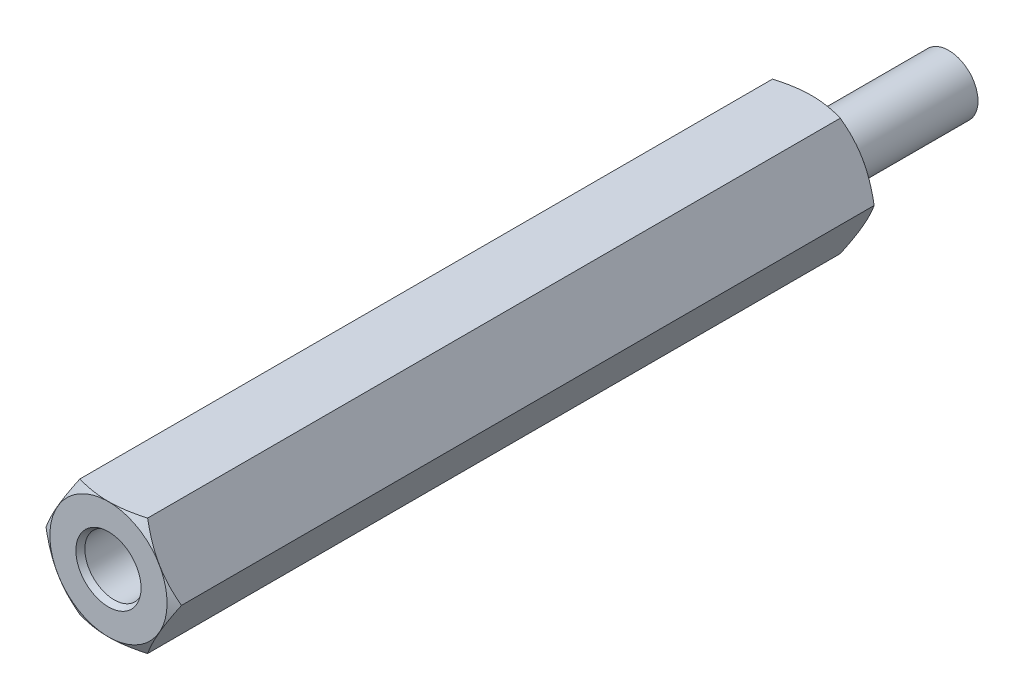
ISO-10303-21;
HEADER;
FILE_DESCRIPTION(('STEP AP214'),'2;1');
FILE_NAME('part.step','',(''),(''),'','','');
FILE_SCHEMA(('AUTOMOTIVE_DESIGN { 1 0 10303 214 1 1 1 1 }'));
ENDSEC;
DATA;
#1=APPLICATION_CONTEXT('core data for automotive mechanical design processes');
#2=APPLICATION_PROTOCOL_DEFINITION('international standard','automotive_design',2000,#1);
#3=PRODUCT_CONTEXT('',#1,'mechanical');
#4=PRODUCT('Part','Part','',(#3));
#5=PRODUCT_RELATED_PRODUCT_CATEGORY('part','',(#4));
#6=PRODUCT_DEFINITION_FORMATION('','',#4);
#7=PRODUCT_DEFINITION_CONTEXT('part definition',#1,'design');
#8=PRODUCT_DEFINITION('design','',#6,#7);
#9=PRODUCT_DEFINITION_SHAPE('','',#8);
#10=(LENGTH_UNIT() NAMED_UNIT(*) SI_UNIT(.MILLI.,.METRE.));
#11=(NAMED_UNIT(*) PLANE_ANGLE_UNIT() SI_UNIT($,.RADIAN.));
#12=(NAMED_UNIT(*) SI_UNIT($,.STERADIAN.) SOLID_ANGLE_UNIT());
#13=UNCERTAINTY_MEASURE_WITH_UNIT(LENGTH_MEASURE(1.E-05),#10,'distance_accuracy_value','');
#14=(GEOMETRIC_REPRESENTATION_CONTEXT(3) GLOBAL_UNCERTAINTY_ASSIGNED_CONTEXT((#13)) GLOBAL_UNIT_ASSIGNED_CONTEXT((#10,
#11,#12)) REPRESENTATION_CONTEXT('',''));
#15=CARTESIAN_POINT('',(0.,0.,0.));
#16=DIRECTION('',(0.,0.,1.));
#17=DIRECTION('',(1.,0.,0.));
#18=AXIS2_PLACEMENT_3D('',#15,#16,#17);
#19=CARTESIAN_POINT('',(0.,0.,24.));
#20=DIRECTION('',(0.,0.,1.));
#21=DIRECTION('',(1.,0.,0.));
#22=AXIS2_PLACEMENT_3D('',#19,#20,#21);
#23=CONICAL_SURFACE('',#22,1.25,1.047197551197);
#24=CARTESIAN_POINT('',(0.,0.,24.));
#25=DIRECTION('',(0.,0.,1.));
#26=DIRECTION('',(1.,0.,0.));
#27=AXIS2_PLACEMENT_3D('',#24,#25,#26);
#28=CIRCLE('',#27,1.25);
#29=CARTESIAN_POINT('',(1.25,0.,24.));
#30=VERTEX_POINT('',#29);
#31=EDGE_CURVE('E25',#30,#30,#28,.T.);
#32=ORIENTED_EDGE('',*,*,#31,.T.);
#33=DIRECTION('',(-0.866025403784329,0.,-0.50000000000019));
#34=VECTOR('',#33,1.);
#35=CARTESIAN_POINT('',(1.25,0.,24.));
#36=LINE('',#35,#34);
#37=CARTESIAN_POINT('',(0.,0.,23.278312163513));
#38=VERTEX_POINT('',#37);
#39=EDGE_CURVE('E11',#30,#38,#36,.T.);
#40=ORIENTED_EDGE('',*,*,#39,.T.);
#41=ORIENTED_EDGE('',*,*,#39,.F.);
#42=EDGE_LOOP('',(#32,#40,#41));
#43=FACE_BOUND('',#42,.T.);
#44=ADVANCED_FACE('F16',(#43),#23,.F.);
#45=CARTESIAN_POINT('',(0.,0.,-6.));
#46=DIRECTION('',(0.,0.,1.));
#47=DIRECTION('',(1.,0.,0.));
#48=AXIS2_PLACEMENT_3D('',#45,#46,#47);
#49=PLANE('',#48);
#50=CARTESIAN_POINT('',(0.,0.,-6.));
#51=DIRECTION('',(0.,0.,1.));
#52=DIRECTION('',(1.,0.,0.));
#53=AXIS2_PLACEMENT_3D('',#50,#51,#52);
#54=CIRCLE('',#53,0.98);
#55=CARTESIAN_POINT('',(0.98,0.,-6.));
#56=VERTEX_POINT('',#55);
#57=EDGE_CURVE('E298',#56,#56,#54,.T.);
#58=ORIENTED_EDGE('',*,*,#57,.F.);
#59=EDGE_LOOP('',(#58));
#60=FACE_BOUND('',#59,.T.);
#61=ADVANCED_FACE('F18',(#60),#49,.F.);
#62=CARTESIAN_POINT('',(0.,0.,29.757512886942));
#63=DIRECTION('',(0.,0.,-1.));
#64=DIRECTION('',(1.,0.,0.));
#65=AXIS2_PLACEMENT_3D('',#62,#63,#64);
#66=CYLINDRICAL_SURFACE('',#65,1.25);
#67=CARTESIAN_POINT('',(0.,0.,29.757512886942));
#68=DIRECTION('',(0.,0.,1.));
#69=DIRECTION('',(1.,0.,0.));
#70=AXIS2_PLACEMENT_3D('',#67,#68,#69);
#71=CIRCLE('',#70,1.25);
#72=CARTESIAN_POINT('',(1.25,0.,29.757512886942));
#73=VERTEX_POINT('',#72);
#74=EDGE_CURVE('E294',#73,#73,#71,.T.);
#75=ORIENTED_EDGE('',*,*,#74,.T.);
#76=DIRECTION('',(0.,0.,-1.));
#77=VECTOR('',#76,1.);
#78=CARTESIAN_POINT('',(1.25,0.,29.757512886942));
#79=LINE('',#78,#77);
#80=EDGE_CURVE('E273',#73,#30,#79,.T.);
#81=ORIENTED_EDGE('',*,*,#80,.T.);
#82=ORIENTED_EDGE('',*,*,#31,.F.);
#83=ORIENTED_EDGE('',*,*,#80,.F.);
#84=EDGE_LOOP('',(#75,#81,#82,#83));
#85=FACE_BOUND('',#84,.T.);
#86=ADVANCED_FACE('F338',(#85),#66,.F.);
#87=CARTESIAN_POINT('',(0.,0.,-6.));
#88=DIRECTION('',(0.,0.,1.));
#89=DIRECTION('',(1.,0.,0.));
#90=AXIS2_PLACEMENT_3D('',#87,#88,#89);
#91=CONICAL_SURFACE('',#90,0.98,1.047197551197);
#92=ORIENTED_EDGE('',*,*,#57,.T.);
#93=DIRECTION('',(0.866025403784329,0.,0.50000000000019));
#94=VECTOR('',#93,1.);
#95=CARTESIAN_POINT('',(0.98,0.,-6.));
#96=LINE('',#95,#94);
#97=CARTESIAN_POINT('',(1.25,0.,-5.844115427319));
#98=VERTEX_POINT('',#97);
#99=EDGE_CURVE('E277',#56,#98,#96,.T.);
#100=ORIENTED_EDGE('',*,*,#99,.T.);
#101=CARTESIAN_POINT('',(0.,0.,-5.844115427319));
#102=DIRECTION('',(0.,0.,1.));
#103=DIRECTION('',(1.,0.,0.));
#104=AXIS2_PLACEMENT_3D('',#101,#102,#103);
#105=CIRCLE('',#104,1.25);
#106=EDGE_CURVE('E283',#98,#98,#105,.T.);
#107=ORIENTED_EDGE('',*,*,#106,.F.);
#108=ORIENTED_EDGE('',*,*,#99,.F.);
#109=EDGE_LOOP('',(#92,#100,#107,#108));
#110=FACE_BOUND('',#109,.T.);
#111=ADVANCED_FACE('F308',(#110),#91,.T.);
#112=CARTESIAN_POINT('',(0.,0.,30.));
#113=DIRECTION('',(0.,0.,1.));
#114=DIRECTION('',(1.,0.,0.));
#115=AXIS2_PLACEMENT_3D('',#112,#113,#114);
#116=CONICAL_SURFACE('',#115,1.39,0.523598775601);
#117=CARTESIAN_POINT('',(0.,0.,30.));
#118=DIRECTION('',(0.,0.,1.));
#119=DIRECTION('',(1.,0.,0.));
#120=AXIS2_PLACEMENT_3D('',#117,#118,#119);
#121=CIRCLE('',#120,1.39);
#122=CARTESIAN_POINT('',(1.39,0.,30.));
#123=VERTEX_POINT('',#122);
#124=EDGE_CURVE('E158',#123,#123,#121,.T.);
#125=ORIENTED_EDGE('',*,*,#124,.T.);
#126=DIRECTION('',(-0.500000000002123,0.,-0.866025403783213));
#127=VECTOR('',#126,1.);
#128=CARTESIAN_POINT('',(1.39,0.,30.));
#129=LINE('',#128,#127);
#130=EDGE_CURVE('E290',#123,#73,#129,.T.);
#131=ORIENTED_EDGE('',*,*,#130,.T.);
#132=ORIENTED_EDGE('',*,*,#74,.F.);
#133=ORIENTED_EDGE('',*,*,#130,.F.);
#134=EDGE_LOOP('',(#125,#131,#132,#133));
#135=FACE_BOUND('',#134,.T.);
#136=ADVANCED_FACE('F341',(#135),#116,.F.);
#137=CARTESIAN_POINT('',(0.,0.,-5.844115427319));
#138=DIRECTION('',(0.,0.,1.));
#139=DIRECTION('',(1.,0.,0.));
#140=AXIS2_PLACEMENT_3D('',#137,#138,#139);
#141=CYLINDRICAL_SURFACE('',#140,1.25);
#142=ORIENTED_EDGE('',*,*,#106,.T.);
#143=DIRECTION('',(0.,0.,1.));
#144=VECTOR('',#143,1.);
#145=CARTESIAN_POINT('',(1.25,0.,-5.844115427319));
#146=LINE('',#145,#144);
#147=CARTESIAN_POINT('',(1.25,0.,0.));
#148=VERTEX_POINT('',#147);
#149=EDGE_CURVE('E287',#98,#148,#146,.T.);
#150=ORIENTED_EDGE('',*,*,#149,.T.);
#151=CARTESIAN_POINT('',(0.,0.,0.));
#152=DIRECTION('',(0.,0.,1.));
#153=DIRECTION('',(1.,0.,0.));
#154=AXIS2_PLACEMENT_3D('',#151,#152,#153);
#155=CIRCLE('',#154,1.25);
#156=EDGE_CURVE('E155',#148,#148,#155,.T.);
#157=ORIENTED_EDGE('',*,*,#156,.F.);
#158=ORIENTED_EDGE('',*,*,#149,.F.);
#159=EDGE_LOOP('',(#142,#150,#157,#158));
#160=FACE_BOUND('',#159,.T.);
#161=ADVANCED_FACE('F312',(#160),#141,.T.);
#162=CARTESIAN_POINT('',(0.,0.,30.));
#163=DIRECTION('',(0.,0.,1.));
#164=DIRECTION('',(1.,0.,0.));
#165=AXIS2_PLACEMENT_3D('',#162,#163,#164);
#166=PLANE('',#165);
#167=ORIENTED_EDGE('',*,*,#124,.F.);
#168=EDGE_LOOP('',(#167));
#169=FACE_BOUND('',#168,.T.);
#170=CARTESIAN_POINT('',(0.,0.,30.));
#171=DIRECTION('',(0.,0.,1.));
#172=DIRECTION('',(1.,0.,0.));
#173=AXIS2_PLACEMENT_3D('',#170,#171,#172);
#174=CIRCLE('',#173,2.5);
#175=CARTESIAN_POINT('',(2.5,0.,30.));
#176=VERTEX_POINT('',#175);
#177=EDGE_CURVE('E164',#176,#176,#174,.T.);
#178=ORIENTED_EDGE('',*,*,#177,.T.);
#179=EDGE_LOOP('',(#178));
#180=FACE_BOUND('',#179,.T.);
#181=ADVANCED_FACE('F317',(#169,#180),#166,.T.);
#182=CARTESIAN_POINT('',(0.,0.,0.));
#183=DIRECTION('',(0.,0.,1.));
#184=DIRECTION('',(1.,0.,0.));
#185=AXIS2_PLACEMENT_3D('',#182,#183,#184);
#186=PLANE('',#185);
#187=CARTESIAN_POINT('',(0.,0.,0.));
#188=DIRECTION('',(0.,0.,1.));
#189=DIRECTION('',(1.,0.,0.));
#190=AXIS2_PLACEMENT_3D('',#187,#188,#189);
#191=CIRCLE('',#190,2.5);
#192=CARTESIAN_POINT('',(2.5,0.,0.));
#193=VERTEX_POINT('',#192);
#194=EDGE_CURVE('E166',#193,#193,#191,.T.);
#195=ORIENTED_EDGE('',*,*,#194,.F.);
#196=EDGE_LOOP('',(#195));
#197=FACE_BOUND('',#196,.T.);
#198=ORIENTED_EDGE('',*,*,#156,.T.);
#199=EDGE_LOOP('',(#198));
#200=FACE_BOUND('',#199,.T.);
#201=ADVANCED_FACE('F314',(#197,#200),#186,.F.);
#202=CARTESIAN_POINT('',(-1.445,-2.502813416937,-10.));
#203=DIRECTION('',(0.,1.,0.));
#204=DIRECTION('',(1.,0.,0.));
#205=AXIS2_PLACEMENT_3D('',#202,#203,#204);
#206=PLANE('',#205);
#207=DIRECTION('',(0.,0.,1.));
#208=VECTOR('',#207,1.);
#209=CARTESIAN_POINT('',(1.445,-2.502813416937,-10.));
#210=LINE('',#209,#208);
#211=CARTESIAN_POINT('',(1.445,-2.502813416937,0.225166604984));
#212=VERTEX_POINT('',#211);
#213=CARTESIAN_POINT('',(1.445,-2.502813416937,29.774833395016));
#214=VERTEX_POINT('',#213);
#215=EDGE_CURVE('E267',#212,#214,#210,.T.);
#216=ORIENTED_EDGE('',*,*,#215,.T.);
#217=CARTESIAN_POINT('',(1.44500000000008,-2.502813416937,29.7748333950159));
#218=CARTESIAN_POINT('',(0.,-2.50281341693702,30.1919689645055));
#219=CARTESIAN_POINT('',(-1.44499999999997,-2.502813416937,29.774833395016));
#220=(BOUNDED_CURVE() B_SPLINE_CURVE(2,(#217,#218,#219),.UNSPECIFIED.,.F.,
.F.) B_SPLINE_CURVE_WITH_KNOTS((3,3),(0.,1.),
.UNSPECIFIED.) CURVE() GEOMETRIC_REPRESENTATION_ITEM() RATIONAL_B_SPLINE_CURVE((1.,
1.15470053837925,1.)) REPRESENTATION_ITEM(''));
#221=CARTESIAN_POINT('',(-1.445,-2.502813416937,29.774833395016));
#222=VERTEX_POINT('',#221);
#223=EDGE_CURVE('E236',#214,#222,#220,.T.);
#224=ORIENTED_EDGE('',*,*,#223,.T.);
#225=DIRECTION('',(0.,0.,1.));
#226=VECTOR('',#225,1.);
#227=CARTESIAN_POINT('',(-1.445,-2.502813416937,-10.));
#228=LINE('',#227,#226);
#229=CARTESIAN_POINT('',(-1.445,-2.502813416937,0.225166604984));
#230=VERTEX_POINT('',#229);
#231=EDGE_CURVE('E159',#230,#222,#228,.T.);
#232=ORIENTED_EDGE('',*,*,#231,.F.);
#233=CARTESIAN_POINT('',(-1.44500000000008,-2.502813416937,0.225166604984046));
#234=CARTESIAN_POINT('',(0.,-2.50281341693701,-0.191968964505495));
#235=CARTESIAN_POINT('',(1.44499999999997,-2.502813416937,0.225166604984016));
#236=(BOUNDED_CURVE() B_SPLINE_CURVE(2,(#233,#234,#235),.UNSPECIFIED.,.F.,
.F.) B_SPLINE_CURVE_WITH_KNOTS((3,3),(0.,1.),
.UNSPECIFIED.) CURVE() GEOMETRIC_REPRESENTATION_ITEM() RATIONAL_B_SPLINE_CURVE((1.,
1.15470053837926,1.)) REPRESENTATION_ITEM(''));
#237=EDGE_CURVE('E197',#230,#212,#236,.T.);
#238=ORIENTED_EDGE('',*,*,#237,.T.);
#239=EDGE_LOOP('',(#216,#224,#232,#238));
#240=FACE_BOUND('',#239,.T.);
#241=ADVANCED_FACE('F316',(#240),#206,.F.);
#242=CARTESIAN_POINT('',(-2.89,0.,-10.));
#243=DIRECTION('',(0.866025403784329,0.50000000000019,0.));
#244=DIRECTION('',(0.,0.,-1.));
#245=AXIS2_PLACEMENT_3D('',#242,#243,#244);
#246=PLANE('',#245);
#247=ORIENTED_EDGE('',*,*,#231,.T.);
#248=CARTESIAN_POINT('',(-1.44499999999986,-2.50281341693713,29.7748333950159));
#249=CARTESIAN_POINT('',(-2.16750000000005,-1.25140670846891,30.1919689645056));
#250=CARTESIAN_POINT('',(-2.89000000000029,-6.22391027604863E-13,29.7748333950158));
#251=(BOUNDED_CURVE() B_SPLINE_CURVE(2,(#248,#249,#250),.UNSPECIFIED.,.F.,
.F.) B_SPLINE_CURVE_WITH_KNOTS((3,3),(0.,1.),
.UNSPECIFIED.) CURVE() GEOMETRIC_REPRESENTATION_ITEM() RATIONAL_B_SPLINE_CURVE((1.,
1.15470053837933,1.)) REPRESENTATION_ITEM(''));
#252=CARTESIAN_POINT('',(-2.89,0.,29.774833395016));
#253=VERTEX_POINT('',#252);
#254=EDGE_CURVE('E230',#222,#253,#251,.T.);
#255=ORIENTED_EDGE('',*,*,#254,.T.);
#256=DIRECTION('',(0.,0.,1.));
#257=VECTOR('',#256,1.);
#258=CARTESIAN_POINT('',(-2.89,0.,-10.));
#259=LINE('',#258,#257);
#260=CARTESIAN_POINT('',(-2.89,0.,0.225166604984));
#261=VERTEX_POINT('',#260);
#262=EDGE_CURVE('E211',#261,#253,#259,.T.);
#263=ORIENTED_EDGE('',*,*,#262,.F.);
#264=CARTESIAN_POINT('',(-2.89000000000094,5.09592368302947E-13,0.225166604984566));
#265=CARTESIAN_POINT('',(-2.16750000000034,-1.2514067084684,-0.191968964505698));
#266=CARTESIAN_POINT('',(-1.44499999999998,-2.50281341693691,0.225166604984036));
#267=(BOUNDED_CURVE() B_SPLINE_CURVE(2,(#264,#265,#266),.UNSPECIFIED.,.F.,
.F.) B_SPLINE_CURVE_WITH_KNOTS((3,3),(0.,1.),
.UNSPECIFIED.) CURVE() GEOMETRIC_REPRESENTATION_ITEM() RATIONAL_B_SPLINE_CURVE((1.,
1.15470053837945,1.)) REPRESENTATION_ITEM(''));
#268=EDGE_CURVE('E205',#261,#230,#267,.T.);
#269=ORIENTED_EDGE('',*,*,#268,.T.);
#270=EDGE_LOOP('',(#247,#255,#263,#269));
#271=FACE_BOUND('',#270,.T.);
#272=ADVANCED_FACE('F325',(#271),#246,.F.);
#273=CARTESIAN_POINT('',(-1.445,2.502813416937,-10.));
#274=DIRECTION('',(0.866025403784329,-0.50000000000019,0.));
#275=DIRECTION('',(0.,0.,-1.));
#276=AXIS2_PLACEMENT_3D('',#273,#274,#275);
#277=PLANE('',#276);
#278=ORIENTED_EDGE('',*,*,#262,.T.);
#279=CARTESIAN_POINT('',(-2.89000000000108,-7.47846229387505E-13,29.7748333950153));
#280=CARTESIAN_POINT('',(-2.1675000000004,1.25140670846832,30.1919689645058));
#281=CARTESIAN_POINT('',(-1.44499999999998,2.50281341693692,29.7748333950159));
#282=(BOUNDED_CURVE() B_SPLINE_CURVE(2,(#279,#280,#281),.UNSPECIFIED.,.F.,
.F.) B_SPLINE_CURVE_WITH_KNOTS((3,3),(0.,1.),
.UNSPECIFIED.) CURVE() GEOMETRIC_REPRESENTATION_ITEM() RATIONAL_B_SPLINE_CURVE((1.,
1.15470053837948,1.)) REPRESENTATION_ITEM(''));
#283=CARTESIAN_POINT('',(-1.445,2.502813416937,29.774833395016));
#284=VERTEX_POINT('',#283);
#285=EDGE_CURVE('E189',#253,#284,#282,.T.);
#286=ORIENTED_EDGE('',*,*,#285,.T.);
#287=DIRECTION('',(0.,0.,1.));
#288=VECTOR('',#287,1.);
#289=CARTESIAN_POINT('',(-1.445,2.502813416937,-10.));
#290=LINE('',#289,#288);
#291=CARTESIAN_POINT('',(-1.445,2.502813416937,0.225166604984));
#292=VERTEX_POINT('',#291);
#293=EDGE_CURVE('E131',#292,#284,#290,.T.);
#294=ORIENTED_EDGE('',*,*,#293,.F.);
#295=CARTESIAN_POINT('',(-1.44499999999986,2.50281341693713,0.225166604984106));
#296=CARTESIAN_POINT('',(-2.16750000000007,1.25140670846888,-0.191968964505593));
#297=CARTESIAN_POINT('',(-2.89000000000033,5.42899059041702E-13,0.225166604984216));
#298=(BOUNDED_CURVE() B_SPLINE_CURVE(2,(#295,#296,#297),.UNSPECIFIED.,.F.,
.F.) B_SPLINE_CURVE_WITH_KNOTS((3,3),(0.,1.),
.UNSPECIFIED.) CURVE() GEOMETRIC_REPRESENTATION_ITEM() RATIONAL_B_SPLINE_CURVE((1.,
1.15470053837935,1.)) REPRESENTATION_ITEM(''));
#299=EDGE_CURVE('E126',#292,#261,#298,.T.);
#300=ORIENTED_EDGE('',*,*,#299,.T.);
#301=EDGE_LOOP('',(#278,#286,#294,#300));
#302=FACE_BOUND('',#301,.T.);
#303=ADVANCED_FACE('F363',(#302),#277,.F.);
#304=CARTESIAN_POINT('',(1.445,-2.502813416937,-10.));
#305=DIRECTION('',(-0.866025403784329,0.50000000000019,0.));
#306=DIRECTION('',(0.,0.,1.));
#307=AXIS2_PLACEMENT_3D('',#304,#305,#306);
#308=PLANE('',#307);
#309=DIRECTION('',(0.,0.,1.));
#310=VECTOR('',#309,1.);
#311=CARTESIAN_POINT('',(2.89,0.,0.225166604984));
#312=LINE('',#311,#310);
#313=CARTESIAN_POINT('',(2.89,0.,0.225166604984));
#314=VERTEX_POINT('',#313);
#315=CARTESIAN_POINT('',(2.89,0.,29.774833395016));
#316=VERTEX_POINT('',#315);
#317=EDGE_CURVE('E139',#314,#316,#312,.T.);
#318=ORIENTED_EDGE('',*,*,#317,.T.);
#319=CARTESIAN_POINT('',(2.89000000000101,6.3860028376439E-13,29.7748333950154));
#320=CARTESIAN_POINT('',(2.16750000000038,-1.25140670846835,30.1919689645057));
#321=CARTESIAN_POINT('',(1.44499999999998,-2.50281341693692,29.7748333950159));
#322=(BOUNDED_CURVE() B_SPLINE_CURVE(2,(#319,#320,#321),.UNSPECIFIED.,.F.,
.F.) B_SPLINE_CURVE_WITH_KNOTS((3,3),(0.,1.),
.UNSPECIFIED.) CURVE() GEOMETRIC_REPRESENTATION_ITEM() RATIONAL_B_SPLINE_CURVE((1.,
1.15470053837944,1.)) REPRESENTATION_ITEM(''));
#323=EDGE_CURVE('E165',#316,#214,#322,.T.);
#324=ORIENTED_EDGE('',*,*,#323,.T.);
#325=ORIENTED_EDGE('',*,*,#215,.F.);
#326=CARTESIAN_POINT('',(1.44499999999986,-2.50281341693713,0.225166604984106));
#327=CARTESIAN_POINT('',(2.16750000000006,-1.25140670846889,-0.191968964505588));
#328=CARTESIAN_POINT('',(2.89000000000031,-5.83089132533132E-13,0.225166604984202));
#329=(BOUNDED_CURVE() B_SPLINE_CURVE(2,(#326,#327,#328),.UNSPECIFIED.,.F.,
.F.) B_SPLINE_CURVE_WITH_KNOTS((3,3),(0.,1.),
.UNSPECIFIED.) CURVE() GEOMETRIC_REPRESENTATION_ITEM() RATIONAL_B_SPLINE_CURVE((1.,
1.15470053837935,1.)) REPRESENTATION_ITEM(''));
#330=EDGE_CURVE('E168',#212,#314,#329,.T.);
#331=ORIENTED_EDGE('',*,*,#330,.T.);
#332=EDGE_LOOP('',(#318,#324,#325,#331));
#333=FACE_BOUND('',#332,.T.);
#334=ADVANCED_FACE('F359',(#333),#308,.F.);
#335=CARTESIAN_POINT('',(0.,0.,29.774833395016));
#336=DIRECTION('',(0.,0.,-1.));
#337=DIRECTION('',(1.,0.,0.));
#338=AXIS2_PLACEMENT_3D('',#335,#336,#337);
#339=CONICAL_SURFACE('',#338,2.89,1.047197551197);
#340=ORIENTED_EDGE('',*,*,#323,.F.);
#341=DIRECTION('',(-0.866025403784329,0.,0.50000000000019));
#342=VECTOR('',#341,1.);
#343=CARTESIAN_POINT('',(2.89,0.,29.774833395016));
#344=LINE('',#343,#342);
#345=EDGE_CURVE('E160',#316,#176,#344,.T.);
#346=ORIENTED_EDGE('',*,*,#345,.T.);
#347=ORIENTED_EDGE('',*,*,#177,.F.);
#348=ORIENTED_EDGE('',*,*,#345,.F.);
#349=CARTESIAN_POINT('',(1.44499999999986,2.50281341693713,29.7748333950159));
#350=CARTESIAN_POINT('',(2.16750000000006,1.25140670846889,30.1919689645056));
#351=CARTESIAN_POINT('',(2.89000000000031,5.85975712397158E-13,29.7748333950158));
#352=(BOUNDED_CURVE() B_SPLINE_CURVE(2,(#349,#350,#351),.UNSPECIFIED.,.F.,
.F.) B_SPLINE_CURVE_WITH_KNOTS((3,3),(0.,1.),
.UNSPECIFIED.) CURVE() GEOMETRIC_REPRESENTATION_ITEM() RATIONAL_B_SPLINE_CURVE((1.,
1.15470053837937,1.)) REPRESENTATION_ITEM(''));
#353=CARTESIAN_POINT('',(1.445,2.502813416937,29.774833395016));
#354=VERTEX_POINT('',#353);
#355=EDGE_CURVE('E148',#354,#316,#352,.T.);
#356=ORIENTED_EDGE('',*,*,#355,.F.);
#357=CARTESIAN_POINT('',(-1.44500000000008,2.502813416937,29.7748333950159));
#358=CARTESIAN_POINT('',(0.,2.50281341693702,30.1919689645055));
#359=CARTESIAN_POINT('',(1.44499999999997,2.502813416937,29.774833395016));
#360=(BOUNDED_CURVE() B_SPLINE_CURVE(2,(#357,#358,#359),.UNSPECIFIED.,.F.,
.F.) B_SPLINE_CURVE_WITH_KNOTS((3,3),(0.,1.),
.UNSPECIFIED.) CURVE() GEOMETRIC_REPRESENTATION_ITEM() RATIONAL_B_SPLINE_CURVE((1.,
1.15470053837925,1.)) REPRESENTATION_ITEM(''));
#361=EDGE_CURVE('E145',#284,#354,#360,.T.);
#362=ORIENTED_EDGE('',*,*,#361,.F.);
#363=ORIENTED_EDGE('',*,*,#285,.F.);
#364=ORIENTED_EDGE('',*,*,#254,.F.);
#365=ORIENTED_EDGE('',*,*,#223,.F.);
#366=EDGE_LOOP('',(#340,#346,#347,#348,#356,#362,#363,#364,#365));
#367=FACE_BOUND('',#366,.T.);
#368=ADVANCED_FACE('F355',(#367),#339,.T.);
#369=CARTESIAN_POINT('',(1.445,2.502813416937,-10.));
#370=DIRECTION('',(0.,-1.,0.));
#371=DIRECTION('',(-1.,0.,0.));
#372=AXIS2_PLACEMENT_3D('',#369,#370,#371);
#373=PLANE('',#372);
#374=ORIENTED_EDGE('',*,*,#293,.T.);
#375=ORIENTED_EDGE('',*,*,#361,.T.);
#376=DIRECTION('',(0.,0.,1.));
#377=VECTOR('',#376,1.);
#378=CARTESIAN_POINT('',(1.445,2.502813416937,-10.));
#379=LINE('',#378,#377);
#380=CARTESIAN_POINT('',(1.445,2.502813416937,0.225166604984));
#381=VERTEX_POINT('',#380);
#382=EDGE_CURVE('E137',#381,#354,#379,.T.);
#383=ORIENTED_EDGE('',*,*,#382,.F.);
#384=CARTESIAN_POINT('',(1.44500000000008,2.502813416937,0.225166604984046));
#385=CARTESIAN_POINT('',(0.,2.50281341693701,-0.191968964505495));
#386=CARTESIAN_POINT('',(-1.44499999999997,2.502813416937,0.225166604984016));
#387=(BOUNDED_CURVE() B_SPLINE_CURVE(2,(#384,#385,#386),.UNSPECIFIED.,.F.,
.F.) B_SPLINE_CURVE_WITH_KNOTS((3,3),(0.,1.),
.UNSPECIFIED.) CURVE() GEOMETRIC_REPRESENTATION_ITEM() RATIONAL_B_SPLINE_CURVE((1.,
1.15470053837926,1.)) REPRESENTATION_ITEM(''));
#388=EDGE_CURVE('E118',#381,#292,#387,.T.);
#389=ORIENTED_EDGE('',*,*,#388,.T.);
#390=EDGE_LOOP('',(#374,#375,#383,#389));
#391=FACE_BOUND('',#390,.T.);
#392=ADVANCED_FACE('F143',(#391),#373,.F.);
#393=CARTESIAN_POINT('',(0.,0.,0.));
#394=DIRECTION('',(0.,0.,1.));
#395=DIRECTION('',(1.,0.,0.));
#396=AXIS2_PLACEMENT_3D('',#393,#394,#395);
#397=CONICAL_SURFACE('',#396,2.5,1.047197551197);
#398=DIRECTION('',(0.866025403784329,0.,0.50000000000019));
#399=VECTOR('',#398,1.);
#400=CARTESIAN_POINT('',(2.5,0.,0.));
#401=LINE('',#400,#399);
#402=EDGE_CURVE('E141',#193,#314,#401,.T.);
#403=ORIENTED_EDGE('',*,*,#402,.F.);
#404=ORIENTED_EDGE('',*,*,#194,.T.);
#405=ORIENTED_EDGE('',*,*,#402,.T.);
#406=ORIENTED_EDGE('',*,*,#330,.F.);
#407=ORIENTED_EDGE('',*,*,#237,.F.);
#408=ORIENTED_EDGE('',*,*,#268,.F.);
#409=ORIENTED_EDGE('',*,*,#299,.F.);
#410=ORIENTED_EDGE('',*,*,#388,.F.);
#411=CARTESIAN_POINT('',(2.89000000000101,-6.28830321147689E-13,0.225166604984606));
#412=CARTESIAN_POINT('',(2.16750000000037,1.25140670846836,-0.191968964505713));
#413=CARTESIAN_POINT('',(1.44499999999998,2.50281341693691,0.225166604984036));
#414=(BOUNDED_CURVE() B_SPLINE_CURVE(2,(#411,#412,#413),.UNSPECIFIED.,.F.,
.F.) B_SPLINE_CURVE_WITH_KNOTS((3,3),(0.,1.),
.UNSPECIFIED.) CURVE() GEOMETRIC_REPRESENTATION_ITEM() RATIONAL_B_SPLINE_CURVE((1.,
1.15470053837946,1.)) REPRESENTATION_ITEM(''));
#415=EDGE_CURVE('E122',#314,#381,#414,.T.);
#416=ORIENTED_EDGE('',*,*,#415,.F.);
#417=EDGE_LOOP('',(#403,#404,#405,#406,#407,#408,#409,#410,#416));
#418=FACE_BOUND('',#417,.T.);
#419=ADVANCED_FACE('F121',(#418),#397,.T.);
#420=CARTESIAN_POINT('',(2.89,0.,-10.));
#421=DIRECTION('',(-0.866025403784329,-0.50000000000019,0.));
#422=DIRECTION('',(-0.50000000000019,0.866025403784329,0.));
#423=AXIS2_PLACEMENT_3D('',#420,#421,#422);
#424=PLANE('',#423);
#425=ORIENTED_EDGE('',*,*,#382,.T.);
#426=ORIENTED_EDGE('',*,*,#355,.T.);
#427=ORIENTED_EDGE('',*,*,#317,.F.);
#428=ORIENTED_EDGE('',*,*,#415,.T.);
#429=EDGE_LOOP('',(#425,#426,#427,#428));
#430=FACE_BOUND('',#429,.T.);
#431=ADVANCED_FACE('F135',(#430),#424,.F.);
#432=CLOSED_SHELL('',(#44,#61,#86,#111,#136,#161,#181,#201,#241,#272,#303,#334,#368,#392,#419,#431));
#433=MANIFOLD_SOLID_BREP('B1',#432);
#434=ADVANCED_BREP_SHAPE_REPRESENTATION('',(#18,#433),#14);
#435=SHAPE_DEFINITION_REPRESENTATION(#9,#434);
ENDSEC;
END-ISO-10303-21;
